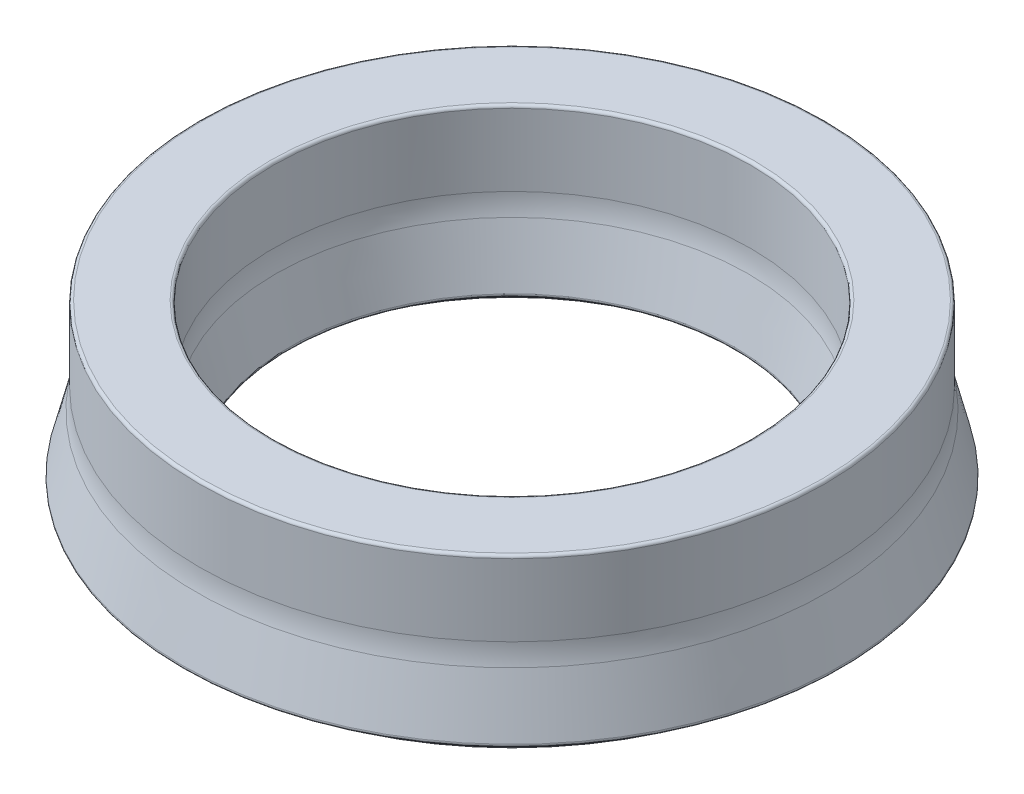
ISO-10303-21;
HEADER;
FILE_DESCRIPTION(('STEP AP214'),'2;1');
FILE_NAME('part.step','',(''),(''),'','','');
FILE_SCHEMA(('AUTOMOTIVE_DESIGN { 1 0 10303 214 1 1 1 1 }'));
ENDSEC;
DATA;
#1=APPLICATION_CONTEXT('core data for automotive mechanical design processes');
#2=APPLICATION_PROTOCOL_DEFINITION('international standard','automotive_design',2000,#1);
#3=PRODUCT_CONTEXT('',#1,'mechanical');
#4=PRODUCT('Part','Part','',(#3));
#5=PRODUCT_RELATED_PRODUCT_CATEGORY('part','',(#4));
#6=PRODUCT_DEFINITION_FORMATION('','',#4);
#7=PRODUCT_DEFINITION_CONTEXT('part definition',#1,'design');
#8=PRODUCT_DEFINITION('design','',#6,#7);
#9=PRODUCT_DEFINITION_SHAPE('','',#8);
#10=(LENGTH_UNIT() NAMED_UNIT(*) SI_UNIT(.MILLI.,.METRE.));
#11=(NAMED_UNIT(*) PLANE_ANGLE_UNIT() SI_UNIT($,.RADIAN.));
#12=(NAMED_UNIT(*) SI_UNIT($,.STERADIAN.) SOLID_ANGLE_UNIT());
#13=UNCERTAINTY_MEASURE_WITH_UNIT(LENGTH_MEASURE(1.E-05),#10,'distance_accuracy_value','');
#14=(GEOMETRIC_REPRESENTATION_CONTEXT(3) GLOBAL_UNCERTAINTY_ASSIGNED_CONTEXT((#13)) GLOBAL_UNIT_ASSIGNED_CONTEXT((#10,
#11,#12)) REPRESENTATION_CONTEXT('',''));
#15=CARTESIAN_POINT('',(0.,0.,0.));
#16=DIRECTION('',(0.,0.,1.));
#17=DIRECTION('',(1.,0.,0.));
#18=AXIS2_PLACEMENT_3D('',#15,#16,#17);
#19=CARTESIAN_POINT('',(2.7305,0.,0.));
#20=DIRECTION('',(0.,-1.,0.));
#21=DIRECTION('',(0.,0.,-1.));
#22=AXIS2_PLACEMENT_3D('',#19,#20,#21);
#23=PLANE('',#22);
#24=CARTESIAN_POINT('',(0.,0.,0.));
#25=DIRECTION('',(0.,-1.,0.));
#26=DIRECTION('',(0.,0.,-1.));
#27=AXIS2_PLACEMENT_3D('',#24,#25,#26);
#28=CIRCLE('',#27,2.74108333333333);
#29=CARTESIAN_POINT('',(0.,0.,-2.74108333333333));
#30=VERTEX_POINT('',#29);
#31=EDGE_CURVE('E61',#30,#30,#28,.F.);
#32=ORIENTED_EDGE('',*,*,#31,.T.);
#33=EDGE_LOOP('',(#32));
#34=FACE_BOUND('',#33,.T.);
#35=CARTESIAN_POINT('',(0.,0.,0.));
#36=DIRECTION('',(0.,-1.,0.));
#37=DIRECTION('',(0.,0.,-1.));
#38=AXIS2_PLACEMENT_3D('',#35,#36,#37);
#39=CIRCLE('',#38,2.82575);
#40=CARTESIAN_POINT('',(0.,0.,-2.82575));
#41=VERTEX_POINT('',#40);
#42=EDGE_CURVE('E64',#41,#41,#39,.T.);
#43=ORIENTED_EDGE('',*,*,#42,.T.);
#44=EDGE_LOOP('',(#43));
#45=FACE_BOUND('',#44,.T.);
#46=ADVANCED_FACE('F24',(#34,#45),#23,.T.);
#47=CARTESIAN_POINT('',(0.,0.,0.));
#48=DIRECTION('',(0.,-1.,0.));
#49=DIRECTION('',(0.,0.,-1.));
#50=AXIS2_PLACEMENT_3D('',#47,#48,#49);
#51=CYLINDRICAL_SURFACE('',#50,2.8575);
#52=CARTESIAN_POINT('',(0.,1.36525,0.));
#53=DIRECTION('',(0.,-1.,0.));
#54=DIRECTION('',(0.,0.,-1.));
#55=AXIS2_PLACEMENT_3D('',#52,#53,#54);
#56=CIRCLE('',#55,2.8575);
#57=CARTESIAN_POINT('',(0.,1.36525,-2.8575));
#58=VERTEX_POINT('',#57);
#59=EDGE_CURVE('E85',#58,#58,#56,.T.);
#60=ORIENTED_EDGE('',*,*,#59,.T.);
#61=EDGE_LOOP('',(#60));
#62=FACE_BOUND('',#61,.T.);
#63=CARTESIAN_POINT('',(0.,0.03175,0.));
#64=DIRECTION('',(0.,-1.,0.));
#65=DIRECTION('',(0.,0.,-1.));
#66=AXIS2_PLACEMENT_3D('',#63,#64,#65);
#67=CIRCLE('',#66,2.8575);
#68=CARTESIAN_POINT('',(0.,0.03175,-2.8575));
#69=VERTEX_POINT('',#68);
#70=EDGE_CURVE('E88',#69,#69,#67,.F.);
#71=ORIENTED_EDGE('',*,*,#70,.T.);
#72=EDGE_LOOP('',(#71));
#73=FACE_BOUND('',#72,.T.);
#74=ADVANCED_FACE('F124',(#62,#73),#51,.T.);
#75=CARTESIAN_POINT('',(2.8575,1.397,0.));
#76=DIRECTION('',(0.,-1.,0.));
#77=DIRECTION('',(0.,0.,-1.));
#78=AXIS2_PLACEMENT_3D('',#75,#76,#77);
#79=PLANE('',#78);
#80=CARTESIAN_POINT('',(0.,1.397,0.));
#81=DIRECTION('',(0.,-1.,0.));
#82=DIRECTION('',(0.,0.,-1.));
#83=AXIS2_PLACEMENT_3D('',#80,#81,#82);
#84=CIRCLE('',#83,2.88925);
#85=CARTESIAN_POINT('',(0.,1.397,-2.88925));
#86=VERTEX_POINT('',#85);
#87=EDGE_CURVE('E79',#86,#86,#84,.F.);
#88=ORIENTED_EDGE('',*,*,#87,.T.);
#89=EDGE_LOOP('',(#88));
#90=FACE_BOUND('',#89,.T.);
#91=CARTESIAN_POINT('',(0.,1.397,0.));
#92=DIRECTION('',(0.,-1.,0.));
#93=DIRECTION('',(0.,0.,-1.));
#94=AXIS2_PLACEMENT_3D('',#91,#92,#93);
#95=CIRCLE('',#94,3.27025);
#96=CARTESIAN_POINT('',(0.,1.397,-3.27025));
#97=VERTEX_POINT('',#96);
#98=EDGE_CURVE('E82',#97,#97,#95,.T.);
#99=ORIENTED_EDGE('',*,*,#98,.T.);
#100=EDGE_LOOP('',(#99));
#101=FACE_BOUND('',#100,.T.);
#102=ADVANCED_FACE('F129',(#90,#101),#79,.T.);
#103=CARTESIAN_POINT('',(0.,0.,0.));
#104=DIRECTION('',(0.,-1.,0.));
#105=DIRECTION('',(0.,0.,-1.));
#106=AXIS2_PLACEMENT_3D('',#103,#104,#105);
#107=CYLINDRICAL_SURFACE('',#106,3.302);
#108=CARTESIAN_POINT('',(0.,1.36525,0.));
#109=DIRECTION('',(0.,-1.,0.));
#110=DIRECTION('',(0.,0.,-1.));
#111=AXIS2_PLACEMENT_3D('',#108,#109,#110);
#112=CIRCLE('',#111,3.302);
#113=CARTESIAN_POINT('',(0.,1.36525,-3.302));
#114=VERTEX_POINT('',#113);
#115=EDGE_CURVE('E73',#114,#114,#112,.F.);
#116=ORIENTED_EDGE('',*,*,#115,.T.);
#117=EDGE_LOOP('',(#116));
#118=FACE_BOUND('',#117,.T.);
#119=CARTESIAN_POINT('',(0.,0.0317500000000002,0.));
#120=DIRECTION('',(0.,-1.,0.));
#121=DIRECTION('',(0.,0.,-1.));
#122=AXIS2_PLACEMENT_3D('',#119,#120,#121);
#123=CIRCLE('',#122,3.302);
#124=CARTESIAN_POINT('',(0.,0.0317500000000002,-3.302));
#125=VERTEX_POINT('',#124);
#126=EDGE_CURVE('E76',#125,#125,#123,.T.);
#127=ORIENTED_EDGE('',*,*,#126,.T.);
#128=EDGE_LOOP('',(#127));
#129=FACE_BOUND('',#128,.T.);
#130=ADVANCED_FACE('F168',(#118,#129),#107,.F.);
#131=CARTESIAN_POINT('',(3.429,0.,0.));
#132=DIRECTION('',(0.,-1.,0.));
#133=DIRECTION('',(0.,0.,-1.));
#134=AXIS2_PLACEMENT_3D('',#131,#132,#133);
#135=PLANE('',#134);
#136=CARTESIAN_POINT('',(0.,0.,0.));
#137=DIRECTION('',(0.,-1.,0.));
#138=DIRECTION('',(0.,0.,-1.));
#139=AXIS2_PLACEMENT_3D('',#136,#137,#138);
#140=CIRCLE('',#139,3.33375);
#141=CARTESIAN_POINT('',(0.,0.,-3.33375));
#142=VERTEX_POINT('',#141);
#143=EDGE_CURVE('E55',#142,#142,#140,.F.);
#144=ORIENTED_EDGE('',*,*,#143,.T.);
#145=EDGE_LOOP('',(#144));
#146=FACE_BOUND('',#145,.T.);
#147=CARTESIAN_POINT('',(0.,0.,0.));
#148=DIRECTION('',(0.,-1.,0.));
#149=DIRECTION('',(0.,0.,-1.));
#150=AXIS2_PLACEMENT_3D('',#147,#148,#149);
#151=CIRCLE('',#150,3.41841666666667);
#152=CARTESIAN_POINT('',(0.,0.,-3.41841666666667));
#153=VERTEX_POINT('',#152);
#154=EDGE_CURVE('E58',#153,#153,#151,.T.);
#155=ORIENTED_EDGE('',*,*,#154,.T.);
#156=EDGE_LOOP('',(#155));
#157=FACE_BOUND('',#156,.T.);
#158=ADVANCED_FACE('F175',(#146,#157),#135,.T.);
#159=CARTESIAN_POINT('',(0.,0.,0.));
#160=DIRECTION('',(0.,1.,0.));
#161=DIRECTION('',(0.,0.,1.));
#162=AXIS2_PLACEMENT_3D('',#159,#160,#161);
#163=CONICAL_SURFACE('',#162,3.429,0.927295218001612);
#164=CARTESIAN_POINT('',(0.,0.00635000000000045,0.));
#165=DIRECTION('',(0.,-1.,0.));
#166=DIRECTION('',(0.,0.,-1.));
#167=AXIS2_PLACEMENT_3D('',#164,#165,#166);
#168=CIRCLE('',#167,3.43746666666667);
#169=CARTESIAN_POINT('',(0.,0.00635000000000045,-3.43746666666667));
#170=VERTEX_POINT('',#169);
#171=EDGE_CURVE('E49',#170,#170,#168,.F.);
#172=ORIENTED_EDGE('',*,*,#171,.T.);
#173=EDGE_LOOP('',(#172));
#174=FACE_BOUND('',#173,.T.);
#175=CARTESIAN_POINT('',(0.,0.17785127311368,0.));
#176=DIRECTION('',(0.,-1.,0.));
#177=DIRECTION('',(0.,0.,-1.));
#178=AXIS2_PLACEMENT_3D('',#175,#176,#177);
#179=CIRCLE('',#178,3.66613503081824);
#180=CARTESIAN_POINT('',(0.,0.17785127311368,-3.66613503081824));
#181=VERTEX_POINT('',#180);
#182=EDGE_CURVE('E52',#181,#181,#179,.T.);
#183=ORIENTED_EDGE('',*,*,#182,.T.);
#184=EDGE_LOOP('',(#183));
#185=FACE_BOUND('',#184,.T.);
#186=ADVANCED_FACE('F181',(#174,#185),#163,.T.);
#187=CARTESIAN_POINT('',(0.,0.1905,0.));
#188=DIRECTION('',(0.,-1.,0.));
#189=DIRECTION('',(0.,0.,-1.));
#190=AXIS2_PLACEMENT_3D('',#187,#188,#189);
#191=CONICAL_SURFACE('',#190,3.683,0.244978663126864);
#192=CARTESIAN_POINT('',(0.,0.210951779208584,0.));
#193=DIRECTION('',(0.,1.,0.));
#194=DIRECTION('',(0.,0.,1.));
#195=AXIS2_PLACEMENT_3D('',#192,#193,#194);
#196=CIRCLE('',#195,3.67788705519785);
#197=CARTESIAN_POINT('',(0.,0.210951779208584,3.67788705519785));
#198=VERTEX_POINT('',#197);
#199=EDGE_CURVE('E10',#198,#198,#196,.T.);
#200=ORIENTED_EDGE('',*,*,#199,.T.);
#201=EDGE_LOOP('',(#200));
#202=FACE_BOUND('',#201,.T.);
#203=CARTESIAN_POINT('',(0.,0.838742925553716,0.));
#204=DIRECTION('',(0.,-1.,0.));
#205=DIRECTION('',(0.,0.,-1.));
#206=AXIS2_PLACEMENT_3D('',#203,#204,#205);
#207=CIRCLE('',#206,3.52093926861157);
#208=CARTESIAN_POINT('',(0.,0.838742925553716,-3.52093926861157));
#209=VERTEX_POINT('',#208);
#210=EDGE_CURVE('E94',#209,#209,#207,.T.);
#211=ORIENTED_EDGE('',*,*,#210,.T.);
#212=EDGE_LOOP('',(#211));
#213=FACE_BOUND('',#212,.T.);
#214=ADVANCED_FACE('F185',(#202,#213),#191,.T.);
#215=CARTESIAN_POINT('',(0.,0.,0.));
#216=DIRECTION('',(0.,-1.,0.));
#217=DIRECTION('',(0.,0.,-1.));
#218=AXIS2_PLACEMENT_3D('',#215,#216,#217);
#219=CYLINDRICAL_SURFACE('',#218,3.4925);
#220=CARTESIAN_POINT('',(0.,1.87325,0.));
#221=DIRECTION('',(0.,1.,0.));
#222=DIRECTION('',(0.,0.,1.));
#223=AXIS2_PLACEMENT_3D('',#220,#221,#222);
#224=CIRCLE('',#223,3.4925);
#225=CARTESIAN_POINT('',(0.,1.87325,3.4925));
#226=VERTEX_POINT('',#225);
#227=EDGE_CURVE('E46',#226,#226,#224,.F.);
#228=ORIENTED_EDGE('',*,*,#227,.T.);
#229=EDGE_LOOP('',(#228));
#230=FACE_BOUND('',#229,.T.);
#231=CARTESIAN_POINT('',(0.,1.06975810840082,0.));
#232=DIRECTION('',(0.,-1.,0.));
#233=DIRECTION('',(0.,0.,-1.));
#234=AXIS2_PLACEMENT_3D('',#231,#232,#233);
#235=CIRCLE('',#234,3.4925);
#236=CARTESIAN_POINT('',(0.,1.06975810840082,-3.4925));
#237=VERTEX_POINT('',#236);
#238=EDGE_CURVE('E91',#237,#237,#235,.F.);
#239=ORIENTED_EDGE('',*,*,#238,.T.);
#240=EDGE_LOOP('',(#239));
#241=FACE_BOUND('',#240,.T.);
#242=ADVANCED_FACE('F189',(#230,#241),#219,.T.);
#243=CARTESIAN_POINT('',(2.667,1.905,0.));
#244=DIRECTION('',(0.,1.,0.));
#245=DIRECTION('',(0.,0.,1.));
#246=AXIS2_PLACEMENT_3D('',#243,#244,#245);
#247=PLANE('',#246);
#248=CARTESIAN_POINT('',(0.,1.905,0.));
#249=DIRECTION('',(0.,1.,0.));
#250=DIRECTION('',(0.,0.,1.));
#251=AXIS2_PLACEMENT_3D('',#248,#249,#250);
#252=CIRCLE('',#251,3.46075);
#253=CARTESIAN_POINT('',(0.,1.905,3.46075));
#254=VERTEX_POINT('',#253);
#255=EDGE_CURVE('E38',#254,#254,#252,.T.);
#256=ORIENTED_EDGE('',*,*,#255,.T.);
#257=EDGE_LOOP('',(#256));
#258=FACE_BOUND('',#257,.T.);
#259=CARTESIAN_POINT('',(0.,1.905,0.));
#260=DIRECTION('',(0.,1.,0.));
#261=DIRECTION('',(0.,0.,1.));
#262=AXIS2_PLACEMENT_3D('',#259,#260,#261);
#263=CIRCLE('',#262,2.69875);
#264=CARTESIAN_POINT('',(0.,1.905,2.69875));
#265=VERTEX_POINT('',#264);
#266=EDGE_CURVE('E43',#265,#265,#263,.F.);
#267=ORIENTED_EDGE('',*,*,#266,.T.);
#268=EDGE_LOOP('',(#267));
#269=FACE_BOUND('',#268,.T.);
#270=ADVANCED_FACE('F192',(#258,#269),#247,.T.);
#271=CARTESIAN_POINT('',(0.,0.,0.));
#272=DIRECTION('',(0.,-1.,0.));
#273=DIRECTION('',(0.,0.,-1.));
#274=AXIS2_PLACEMENT_3D('',#271,#272,#273);
#275=CYLINDRICAL_SURFACE('',#274,2.667);
#276=CARTESIAN_POINT('',(0.,1.87325,0.));
#277=DIRECTION('',(0.,1.,0.));
#278=DIRECTION('',(0.,0.,1.));
#279=AXIS2_PLACEMENT_3D('',#276,#277,#278);
#280=CIRCLE('',#279,2.667);
#281=CARTESIAN_POINT('',(0.,1.87325,2.667));
#282=VERTEX_POINT('',#281);
#283=EDGE_CURVE('E34',#282,#282,#280,.T.);
#284=ORIENTED_EDGE('',*,*,#283,.T.);
#285=EDGE_LOOP('',(#284));
#286=FACE_BOUND('',#285,.T.);
#287=CARTESIAN_POINT('',(0.,1.06975810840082,0.));
#288=DIRECTION('',(0.,-1.,0.));
#289=DIRECTION('',(0.,0.,-1.));
#290=AXIS2_PLACEMENT_3D('',#287,#288,#289);
#291=CIRCLE('',#290,2.667);
#292=CARTESIAN_POINT('',(0.,1.06975810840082,-2.667));
#293=VERTEX_POINT('',#292);
#294=EDGE_CURVE('E100',#293,#293,#291,.T.);
#295=ORIENTED_EDGE('',*,*,#294,.T.);
#296=EDGE_LOOP('',(#295));
#297=FACE_BOUND('',#296,.T.);
#298=ADVANCED_FACE('F104',(#286,#297),#275,.F.);
#299=CARTESIAN_POINT('',(0.,0.9525,0.));
#300=DIRECTION('',(0.,1.,0.));
#301=DIRECTION('',(0.,0.,1.));
#302=AXIS2_PLACEMENT_3D('',#299,#300,#301);
#303=CONICAL_SURFACE('',#302,2.667,0.244978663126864);
#304=CARTESIAN_POINT('',(0.,0.210951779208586,0.));
#305=DIRECTION('',(0.,-1.,0.));
#306=DIRECTION('',(0.,0.,-1.));
#307=AXIS2_PLACEMENT_3D('',#304,#305,#306);
#308=CIRCLE('',#307,2.48161294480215);
#309=CARTESIAN_POINT('',(0.,0.210951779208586,-2.48161294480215));
#310=VERTEX_POINT('',#309);
#311=EDGE_CURVE('E30',#310,#310,#308,.T.);
#312=ORIENTED_EDGE('',*,*,#311,.T.);
#313=EDGE_LOOP('',(#312));
#314=FACE_BOUND('',#313,.T.);
#315=CARTESIAN_POINT('',(0.,0.838742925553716,0.));
#316=DIRECTION('',(0.,1.,0.));
#317=DIRECTION('',(0.,0.,1.));
#318=AXIS2_PLACEMENT_3D('',#315,#316,#317);
#319=CIRCLE('',#318,2.63856073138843);
#320=CARTESIAN_POINT('',(0.,0.838742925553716,2.63856073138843));
#321=VERTEX_POINT('',#320);
#322=EDGE_CURVE('E97',#321,#321,#319,.T.);
#323=ORIENTED_EDGE('',*,*,#322,.T.);
#324=EDGE_LOOP('',(#323));
#325=FACE_BOUND('',#324,.T.);
#326=ADVANCED_FACE('F119',(#314,#325),#303,.F.);
#327=CARTESIAN_POINT('',(0.,0.1905,0.));
#328=DIRECTION('',(0.,-1.,0.));
#329=DIRECTION('',(0.,0.,-1.));
#330=AXIS2_PLACEMENT_3D('',#327,#328,#329);
#331=CONICAL_SURFACE('',#330,2.4765,0.927295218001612);
#332=CARTESIAN_POINT('',(0.,0.00634999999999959,0.));
#333=DIRECTION('',(0.,1.,0.));
#334=DIRECTION('',(0.,0.,1.));
#335=AXIS2_PLACEMENT_3D('',#332,#333,#334);
#336=CIRCLE('',#335,2.72203333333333);
#337=CARTESIAN_POINT('',(0.,0.00634999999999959,2.72203333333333));
#338=VERTEX_POINT('',#337);
#339=EDGE_CURVE('E67',#338,#338,#336,.F.);
#340=ORIENTED_EDGE('',*,*,#339,.T.);
#341=EDGE_LOOP('',(#340));
#342=FACE_BOUND('',#341,.T.);
#343=CARTESIAN_POINT('',(0.,0.17785127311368,0.));
#344=DIRECTION('',(0.,1.,0.));
#345=DIRECTION('',(0.,0.,1.));
#346=AXIS2_PLACEMENT_3D('',#343,#344,#345);
#347=CIRCLE('',#346,2.49336496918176);
#348=CARTESIAN_POINT('',(0.,0.17785127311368,2.49336496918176));
#349=VERTEX_POINT('',#348);
#350=EDGE_CURVE('E70',#349,#349,#347,.T.);
#351=ORIENTED_EDGE('',*,*,#350,.T.);
#352=EDGE_LOOP('',(#351));
#353=FACE_BOUND('',#352,.T.);
#354=ADVANCED_FACE('F109',(#342,#353),#331,.F.);
#355=CARTESIAN_POINT('',(0.,1.06975810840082,0.));
#356=DIRECTION('',(0.,-1.,0.));
#357=DIRECTION('',(0.,0.,-1.));
#358=AXIS2_PLACEMENT_3D('',#355,#356,#357);
#359=TOROIDAL_SURFACE('',#358,1.7145,0.9525);
#360=ORIENTED_EDGE('',*,*,#322,.F.);
#361=EDGE_LOOP('',(#360));
#362=FACE_BOUND('',#361,.T.);
#363=ORIENTED_EDGE('',*,*,#294,.F.);
#364=EDGE_LOOP('',(#363));
#365=FACE_BOUND('',#364,.T.);
#366=ADVANCED_FACE('F106',(#362,#365),#359,.F.);
#367=CARTESIAN_POINT('',(0.,1.06975810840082,0.));
#368=DIRECTION('',(0.,-1.,0.));
#369=DIRECTION('',(0.,0.,-1.));
#370=AXIS2_PLACEMENT_3D('',#367,#368,#369);
#371=TOROIDAL_SURFACE('',#370,4.445,0.9525);
#372=ORIENTED_EDGE('',*,*,#238,.F.);
#373=EDGE_LOOP('',(#372));
#374=FACE_BOUND('',#373,.T.);
#375=ORIENTED_EDGE('',*,*,#210,.F.);
#376=EDGE_LOOP('',(#375));
#377=FACE_BOUND('',#376,.T.);
#378=ADVANCED_FACE('F108',(#374,#377),#371,.F.);
#379=CARTESIAN_POINT('',(0.,1.36525,0.));
#380=DIRECTION('',(0.,-1.,0.));
#381=DIRECTION('',(0.,0.,-1.));
#382=AXIS2_PLACEMENT_3D('',#379,#380,#381);
#383=TOROIDAL_SURFACE('',#382,2.88925,0.03175);
#384=ORIENTED_EDGE('',*,*,#87,.F.);
#385=EDGE_LOOP('',(#384));
#386=FACE_BOUND('',#385,.T.);
#387=ORIENTED_EDGE('',*,*,#59,.F.);
#388=EDGE_LOOP('',(#387));
#389=FACE_BOUND('',#388,.T.);
#390=ADVANCED_FACE('F115',(#386,#389),#383,.F.);
#391=CARTESIAN_POINT('',(0.,1.36525,0.));
#392=DIRECTION('',(0.,-1.,0.));
#393=DIRECTION('',(0.,0.,-1.));
#394=AXIS2_PLACEMENT_3D('',#391,#392,#393);
#395=TOROIDAL_SURFACE('',#394,3.27025,0.03175);
#396=ORIENTED_EDGE('',*,*,#115,.F.);
#397=EDGE_LOOP('',(#396));
#398=FACE_BOUND('',#397,.T.);
#399=ORIENTED_EDGE('',*,*,#98,.F.);
#400=EDGE_LOOP('',(#399));
#401=FACE_BOUND('',#400,.T.);
#402=ADVANCED_FACE('F148',(#398,#401),#395,.F.);
#403=CARTESIAN_POINT('',(0.,0.03175,0.));
#404=DIRECTION('',(0.,-1.,0.));
#405=DIRECTION('',(0.,0.,-1.));
#406=AXIS2_PLACEMENT_3D('',#403,#404,#405);
#407=TOROIDAL_SURFACE('',#406,2.74108333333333,0.03175);
#408=ORIENTED_EDGE('',*,*,#31,.F.);
#409=EDGE_LOOP('',(#408));
#410=FACE_BOUND('',#409,.T.);
#411=ORIENTED_EDGE('',*,*,#339,.F.);
#412=EDGE_LOOP('',(#411));
#413=FACE_BOUND('',#412,.T.);
#414=ADVANCED_FACE('F138',(#410,#413),#407,.T.);
#415=CARTESIAN_POINT('',(0.,0.03175,0.));
#416=DIRECTION('',(0.,-1.,0.));
#417=DIRECTION('',(0.,0.,-1.));
#418=AXIS2_PLACEMENT_3D('',#415,#416,#417);
#419=TOROIDAL_SURFACE('',#418,2.82575,0.03175);
#420=ORIENTED_EDGE('',*,*,#70,.F.);
#421=EDGE_LOOP('',(#420));
#422=FACE_BOUND('',#421,.T.);
#423=ORIENTED_EDGE('',*,*,#42,.F.);
#424=EDGE_LOOP('',(#423));
#425=FACE_BOUND('',#424,.T.);
#426=ADVANCED_FACE('F135',(#422,#425),#419,.T.);
#427=CARTESIAN_POINT('',(0.,0.0317500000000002,0.));
#428=DIRECTION('',(0.,-1.,0.));
#429=DIRECTION('',(0.,0.,-1.));
#430=AXIS2_PLACEMENT_3D('',#427,#428,#429);
#431=TOROIDAL_SURFACE('',#430,3.33375,0.03175);
#432=ORIENTED_EDGE('',*,*,#143,.F.);
#433=EDGE_LOOP('',(#432));
#434=FACE_BOUND('',#433,.T.);
#435=ORIENTED_EDGE('',*,*,#126,.F.);
#436=EDGE_LOOP('',(#435));
#437=FACE_BOUND('',#436,.T.);
#438=ADVANCED_FACE('F137',(#434,#437),#431,.T.);
#439=CARTESIAN_POINT('',(0.,0.0317500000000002,0.));
#440=DIRECTION('',(0.,-1.,0.));
#441=DIRECTION('',(0.,0.,-1.));
#442=AXIS2_PLACEMENT_3D('',#439,#440,#441);
#443=TOROIDAL_SURFACE('',#442,3.41841666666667,0.03175);
#444=ORIENTED_EDGE('',*,*,#171,.F.);
#445=EDGE_LOOP('',(#444));
#446=FACE_BOUND('',#445,.T.);
#447=ORIENTED_EDGE('',*,*,#154,.F.);
#448=EDGE_LOOP('',(#447));
#449=FACE_BOUND('',#448,.T.);
#450=ADVANCED_FACE('F145',(#446,#449),#443,.T.);
#451=CARTESIAN_POINT('',(0.,1.87325,0.));
#452=DIRECTION('',(0.,1.,0.));
#453=DIRECTION('',(0.,0.,1.));
#454=AXIS2_PLACEMENT_3D('',#451,#452,#453);
#455=TOROIDAL_SURFACE('',#454,3.46075,0.03175);
#456=ORIENTED_EDGE('',*,*,#255,.F.);
#457=EDGE_LOOP('',(#456));
#458=FACE_BOUND('',#457,.T.);
#459=ORIENTED_EDGE('',*,*,#227,.F.);
#460=EDGE_LOOP('',(#459));
#461=FACE_BOUND('',#460,.T.);
#462=ADVANCED_FACE('F239',(#458,#461),#455,.T.);
#463=CARTESIAN_POINT('',(0.,1.87325,0.));
#464=DIRECTION('',(0.,1.,0.));
#465=DIRECTION('',(0.,0.,1.));
#466=AXIS2_PLACEMENT_3D('',#463,#464,#465);
#467=TOROIDAL_SURFACE('',#466,2.69875,0.03175);
#468=ORIENTED_EDGE('',*,*,#283,.F.);
#469=EDGE_LOOP('',(#468));
#470=FACE_BOUND('',#469,.T.);
#471=ORIENTED_EDGE('',*,*,#266,.F.);
#472=EDGE_LOOP('',(#471));
#473=FACE_BOUND('',#472,.T.);
#474=ADVANCED_FACE('F246',(#470,#473),#467,.T.);
#475=CARTESIAN_POINT('',(0.,0.20325127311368,0.));
#476=DIRECTION('',(0.,1.,0.));
#477=DIRECTION('',(0.,0.,1.));
#478=AXIS2_PLACEMENT_3D('',#475,#476,#477);
#479=TOROIDAL_SURFACE('',#478,2.51241496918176,0.03175);
#480=ORIENTED_EDGE('',*,*,#350,.F.);
#481=EDGE_LOOP('',(#480));
#482=FACE_BOUND('',#481,.T.);
#483=ORIENTED_EDGE('',*,*,#311,.F.);
#484=EDGE_LOOP('',(#483));
#485=FACE_BOUND('',#484,.T.);
#486=ADVANCED_FACE('F254',(#482,#485),#479,.T.);
#487=CARTESIAN_POINT('',(0.,0.20325127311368,0.));
#488=DIRECTION('',(0.,1.,0.));
#489=DIRECTION('',(0.,0.,1.));
#490=AXIS2_PLACEMENT_3D('',#487,#488,#489);
#491=TOROIDAL_SURFACE('',#490,3.64708503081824,0.03175);
#492=ORIENTED_EDGE('',*,*,#199,.F.);
#493=EDGE_LOOP('',(#492));
#494=FACE_BOUND('',#493,.T.);
#495=ORIENTED_EDGE('',*,*,#182,.F.);
#496=EDGE_LOOP('',(#495));
#497=FACE_BOUND('',#496,.T.);
#498=ADVANCED_FACE('F262',(#494,#497),#491,.T.);
#499=CLOSED_SHELL('',(#46,#74,#102,#130,#158,#186,#214,#242,#270,#298,#326,#354,#366,#378,#390,
#402,#414,#426,#438,#450,#462,#474,#486,#498));
#500=MANIFOLD_SOLID_BREP('B2',#499);
#501=ADVANCED_BREP_SHAPE_REPRESENTATION('',(#18,#500),#14);
#502=SHAPE_DEFINITION_REPRESENTATION(#9,#501);
ENDSEC;
END-ISO-10303-21;
